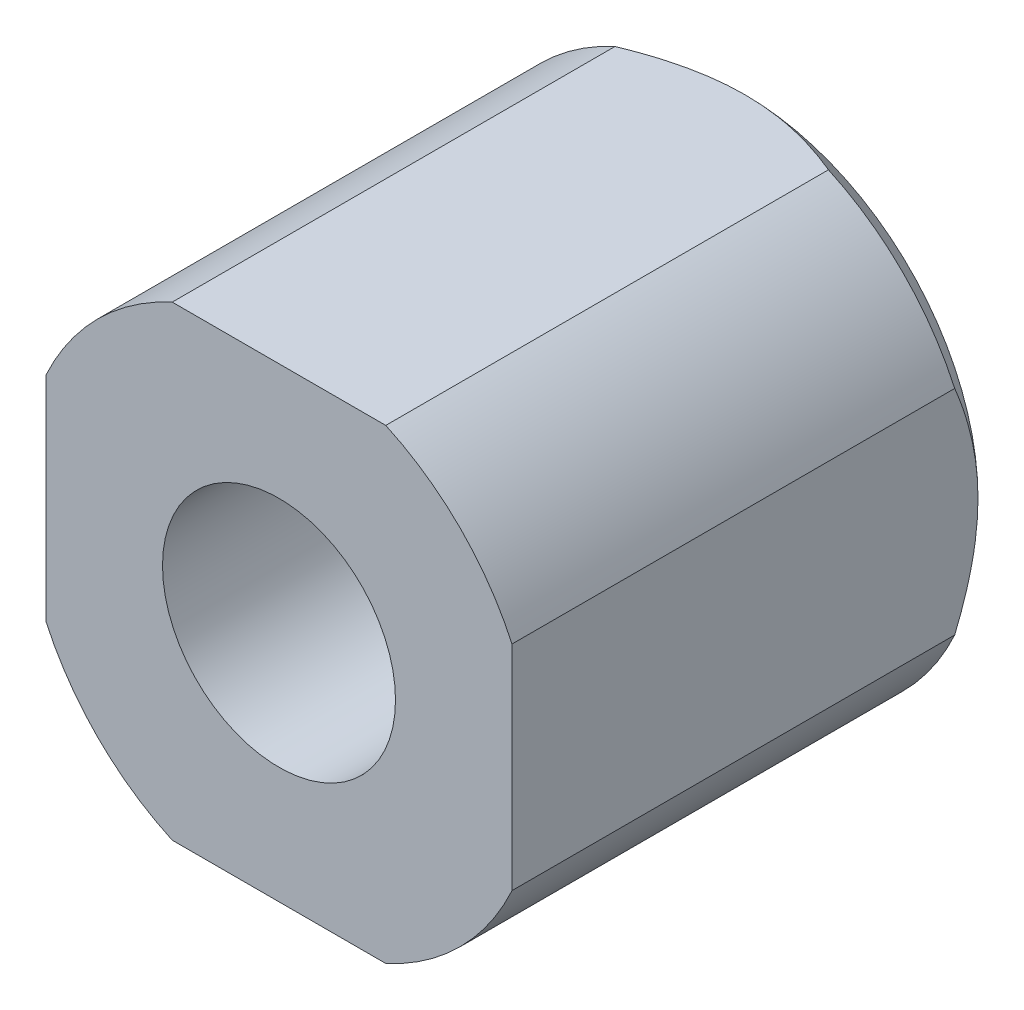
ISO-10303-21;
HEADER;
FILE_DESCRIPTION(('STEP AP214'),'2;1');
FILE_NAME('part.step','',(''),(''),'','','');
FILE_SCHEMA(('AUTOMOTIVE_DESIGN { 1 0 10303 214 1 1 1 1 }'));
ENDSEC;
DATA;
#1=APPLICATION_CONTEXT('core data for automotive mechanical design processes');
#2=APPLICATION_PROTOCOL_DEFINITION('international standard','automotive_design',2000,#1);
#3=PRODUCT_CONTEXT('',#1,'mechanical');
#4=PRODUCT('Part','Part','',(#3));
#5=PRODUCT_RELATED_PRODUCT_CATEGORY('part','',(#4));
#6=PRODUCT_DEFINITION_FORMATION('','',#4);
#7=PRODUCT_DEFINITION_CONTEXT('part definition',#1,'design');
#8=PRODUCT_DEFINITION('design','',#6,#7);
#9=PRODUCT_DEFINITION_SHAPE('','',#8);
#10=(LENGTH_UNIT() NAMED_UNIT(*) SI_UNIT(.MILLI.,.METRE.));
#11=(NAMED_UNIT(*) PLANE_ANGLE_UNIT() SI_UNIT($,.RADIAN.));
#12=(NAMED_UNIT(*) SI_UNIT($,.STERADIAN.) SOLID_ANGLE_UNIT());
#13=UNCERTAINTY_MEASURE_WITH_UNIT(LENGTH_MEASURE(1.E-05),#10,'distance_accuracy_value','');
#14=(GEOMETRIC_REPRESENTATION_CONTEXT(3) GLOBAL_UNCERTAINTY_ASSIGNED_CONTEXT((#13)) GLOBAL_UNIT_ASSIGNED_CONTEXT((#10,
#11,#12)) REPRESENTATION_CONTEXT('',''));
#15=CARTESIAN_POINT('',(0.,0.,0.));
#16=DIRECTION('',(0.,0.,1.));
#17=DIRECTION('',(1.,0.,0.));
#18=AXIS2_PLACEMENT_3D('',#15,#16,#17);
#19=CARTESIAN_POINT('',(10.,10.,20.));
#20=DIRECTION('',(0.,-1.,0.));
#21=DIRECTION('',(1.,0.,0.));
#22=AXIS2_PLACEMENT_3D('',#19,#20,#21);
#23=PLANE('',#22);
#24=DIRECTION('',(0.,0.,-1.));
#25=VECTOR('',#24,1.);
#26=CARTESIAN_POINT('',(4.58257569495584,10.,20.));
#27=LINE('',#26,#25);
#28=CARTESIAN_POINT('',(4.58257569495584,10.,1.));
#29=VERTEX_POINT('',#28);
#30=CARTESIAN_POINT('',(4.58257569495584,10.,20.));
#31=VERTEX_POINT('',#30);
#32=EDGE_CURVE('E239',#29,#31,#27,.F.);
#33=ORIENTED_EDGE('',*,*,#32,.F.);
#34=CARTESIAN_POINT('',(0.,10.,5.10430155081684E-12));
#35=CARTESIAN_POINT('',(0.153419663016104,10.,-1.77624107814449E-05));
#36=CARTESIAN_POINT('',(0.306833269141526,10.,0.00353016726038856));
#37=CARTESIAN_POINT('',(0.613315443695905,10.,0.0176254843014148));
#38=CARTESIAN_POINT('',(0.766384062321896,10.,0.0281717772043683));
#39=CARTESIAN_POINT('',(1.07166096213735,10.,0.0561108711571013));
#40=CARTESIAN_POINT('',(1.22387019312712,10.,0.0734933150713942));
#41=CARTESIAN_POINT('',(1.52738320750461,10.,0.114854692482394));
#42=CARTESIAN_POINT('',(1.67868696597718,10.,0.138833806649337));
#43=CARTESIAN_POINT('',(2.12685071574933,10.,0.219491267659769));
#44=CARTESIAN_POINT('',(2.42210425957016,10.,0.285285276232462));
#45=CARTESIAN_POINT('',(3.00688490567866,10.,0.438467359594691));
#46=CARTESIAN_POINT('',(3.29641147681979,10.,0.525857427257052));
#47=CARTESIAN_POINT('',(3.75125759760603,10.,0.67926794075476));
#48=CARTESIAN_POINT('',(3.91864293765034,10.,0.739275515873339));
#49=CARTESIAN_POINT('',(4.25191342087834,10.,0.865307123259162));
#50=CARTESIAN_POINT('',(4.41778971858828,10.,0.931354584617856));
#51=CARTESIAN_POINT('',(4.58257569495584,10.,1.));
#52=B_SPLINE_CURVE_WITH_KNOTS('',3,(#34,#35,#36,#37,#38,#39,#40,#41,#42,#43,#44,#45,#46,#47,#48,
#49,#50,#51),.UNSPECIFIED.,.F.,.F.,(4,2,2,2,2,2,2,2,4),(0.,0.460207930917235,0.920343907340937,
1.37978542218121,1.83923952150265,2.74570852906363,3.65226121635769,4.18561484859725,
4.72113306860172),.UNSPECIFIED.);
#53=CARTESIAN_POINT('',(0.,9.99999999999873,3.82855778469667E-12));
#54=VERTEX_POINT('',#53);
#55=EDGE_CURVE('E177',#54,#29,#52,.T.);
#56=ORIENTED_EDGE('',*,*,#55,.F.);
#57=CARTESIAN_POINT('',(-4.58257569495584,10.,1.));
#58=CARTESIAN_POINT('',(-4.40028329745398,10.,0.924069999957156));
#59=CARTESIAN_POINT('',(-4.21668434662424,10.,0.851318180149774));
#60=CARTESIAN_POINT('',(-3.84668711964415,10.,0.712956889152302));
#61=CARTESIAN_POINT('',(-3.66028713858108,10.,0.647351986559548));
#62=CARTESIAN_POINT('',(-3.10086162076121,10.,0.463858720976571));
#63=CARTESIAN_POINT('',(-2.72381902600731,10.,0.357678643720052));
#64=CARTESIAN_POINT('',(-2.15145029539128,10.,0.227123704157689));
#65=CARTESIAN_POINT('',(-1.95932775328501,10.,0.188366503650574));
#66=CARTESIAN_POINT('',(-1.57326186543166,10.,0.121217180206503));
#67=CARTESIAN_POINT('',(-1.37931860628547,10.,0.0928245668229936));
#68=CARTESIAN_POINT('',(-0.988206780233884,10.,0.0468172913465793));
#69=CARTESIAN_POINT('',(-0.791025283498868,10.,0.0293119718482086));
#70=CARTESIAN_POINT('',(-0.395902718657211,10.,0.00587701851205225));
#71=CARTESIAN_POINT('',(-0.197961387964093,10.,-4.81679352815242E-05));
#72=CARTESIAN_POINT('',(0.,10.,5.10354999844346E-12));
#73=B_SPLINE_CURVE_WITH_KNOTS('',3,(#57,#58,#59,#60,#61,#62,#63,#64,#65,#66,#67,#68,#69,#70,#71,
#72),.UNSPECIFIED.,.F.,.F.,(4,2,2,2,2,2,2,4),(0.,0.592342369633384,1.18506119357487,
2.3581712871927,2.94592281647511,3.53364653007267,4.12718135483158,4.72094408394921),.UNSPECIFIED.);
#74=CARTESIAN_POINT('',(-4.58257569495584,10.,1.));
#75=VERTEX_POINT('',#74);
#76=EDGE_CURVE('E184',#75,#54,#73,.T.);
#77=ORIENTED_EDGE('',*,*,#76,.F.);
#78=DIRECTION('',(0.,0.,-1.));
#79=VECTOR('',#78,1.);
#80=CARTESIAN_POINT('',(-4.58257569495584,10.,20.));
#81=LINE('',#80,#79);
#82=CARTESIAN_POINT('',(-4.58257569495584,10.,20.));
#83=VERTEX_POINT('',#82);
#84=EDGE_CURVE('E230',#83,#75,#81,.T.);
#85=ORIENTED_EDGE('',*,*,#84,.F.);
#86=DIRECTION('',(1.,0.,0.));
#87=VECTOR('',#86,1.);
#88=CARTESIAN_POINT('',(0.,10.,20.));
#89=LINE('',#88,#87);
#90=EDGE_CURVE('E221',#31,#83,#89,.F.);
#91=ORIENTED_EDGE('',*,*,#90,.F.);
#92=EDGE_LOOP('',(#33,#56,#77,#85,#91));
#93=FACE_BOUND('',#92,.T.);
#94=ADVANCED_FACE('F14',(#93),#23,.F.);
#95=CARTESIAN_POINT('',(0.,0.,20.));
#96=DIRECTION('',(0.,0.,-1.));
#97=DIRECTION('',(-1.,0.,0.));
#98=AXIS2_PLACEMENT_3D('',#95,#96,#97);
#99=CYLINDRICAL_SURFACE('',#98,11.);
#100=CARTESIAN_POINT('',(0.,0.,20.));
#101=DIRECTION('',(0.,0.,-1.));
#102=DIRECTION('',(-1.,0.,0.));
#103=AXIS2_PLACEMENT_3D('',#100,#101,#102);
#104=CIRCLE('',#103,11.);
#105=CARTESIAN_POINT('',(-10.,4.58257569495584,20.));
#106=VERTEX_POINT('',#105);
#107=EDGE_CURVE('E220',#83,#106,#104,.F.);
#108=ORIENTED_EDGE('',*,*,#107,.F.);
#109=ORIENTED_EDGE('',*,*,#84,.T.);
#110=CARTESIAN_POINT('',(0.,0.,1.));
#111=DIRECTION('',(0.,0.,1.));
#112=DIRECTION('',(1.,0.,0.));
#113=AXIS2_PLACEMENT_3D('',#110,#111,#112);
#114=CIRCLE('',#113,11.);
#115=CARTESIAN_POINT('',(-10.,4.58257569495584,1.));
#116=VERTEX_POINT('',#115);
#117=EDGE_CURVE('E189',#116,#75,#114,.F.);
#118=ORIENTED_EDGE('',*,*,#117,.F.);
#119=DIRECTION('',(0.,0.,-1.));
#120=VECTOR('',#119,1.);
#121=CARTESIAN_POINT('',(-10.,4.58257569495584,20.));
#122=LINE('',#121,#120);
#123=EDGE_CURVE('E232',#116,#106,#122,.F.);
#124=ORIENTED_EDGE('',*,*,#123,.T.);
#125=EDGE_LOOP('',(#108,#109,#118,#124));
#126=FACE_BOUND('',#125,.T.);
#127=ADVANCED_FACE('F254',(#126),#99,.T.);
#128=CARTESIAN_POINT('',(-10.,10.,20.));
#129=DIRECTION('',(1.,0.,0.));
#130=DIRECTION('',(0.,0.,-1.));
#131=AXIS2_PLACEMENT_3D('',#128,#129,#130);
#132=PLANE('',#131);
#133=ORIENTED_EDGE('',*,*,#123,.F.);
#134=CARTESIAN_POINT('',(-10.,0.,5.10432619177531E-12));
#135=CARTESIAN_POINT('',(-10.,0.153419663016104,-1.77624107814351E-05));
#136=CARTESIAN_POINT('',(-10.,0.306833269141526,0.00353016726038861));
#137=CARTESIAN_POINT('',(-10.,0.613315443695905,0.017625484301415));
#138=CARTESIAN_POINT('',(-10.,0.766384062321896,0.0281717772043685));
#139=CARTESIAN_POINT('',(-10.,1.07166096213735,0.0561108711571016));
#140=CARTESIAN_POINT('',(-10.,1.22387019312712,0.0734933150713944));
#141=CARTESIAN_POINT('',(-10.,1.52738320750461,0.114854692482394));
#142=CARTESIAN_POINT('',(-10.,1.67868696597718,0.138833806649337));
#143=CARTESIAN_POINT('',(-10.,2.12685071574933,0.219491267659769));
#144=CARTESIAN_POINT('',(-10.,2.42210425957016,0.285285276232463));
#145=CARTESIAN_POINT('',(-10.,3.00688490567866,0.438467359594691));
#146=CARTESIAN_POINT('',(-10.,3.29641147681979,0.525857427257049));
#147=CARTESIAN_POINT('',(-10.,3.75125759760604,0.679267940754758));
#148=CARTESIAN_POINT('',(-10.,3.91864293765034,0.739275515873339));
#149=CARTESIAN_POINT('',(-10.,4.25191342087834,0.865307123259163));
#150=CARTESIAN_POINT('',(-10.,4.41778971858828,0.931354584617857));
#151=CARTESIAN_POINT('',(-10.,4.58257569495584,1.));
#152=B_SPLINE_CURVE_WITH_KNOTS('',3,(#134,#135,#136,#137,#138,#139,#140,#141,#142,#143,#144,
#145,#146,#147,#148,#149,#150,#151),.UNSPECIFIED.,.F.,.F.,(4,2,2,2,2,2,2,2,4),(0.,
0.460207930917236,0.920343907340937,1.37978542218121,1.83923952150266,2.74570852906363,
3.65226121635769,4.18561484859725,4.72113306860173),.UNSPECIFIED.);
#153=CARTESIAN_POINT('',(-9.99999999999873,0.,3.82858023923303E-12));
#154=VERTEX_POINT('',#153);
#155=EDGE_CURVE('E18',#154,#116,#152,.T.);
#156=ORIENTED_EDGE('',*,*,#155,.F.);
#157=CARTESIAN_POINT('',(-10.,-4.58257569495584,1.));
#158=CARTESIAN_POINT('',(-10.,-4.40028329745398,0.924069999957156));
#159=CARTESIAN_POINT('',(-10.,-4.21668434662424,0.851318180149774));
#160=CARTESIAN_POINT('',(-10.,-3.84668711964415,0.712956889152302));
#161=CARTESIAN_POINT('',(-10.,-3.66028713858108,0.647351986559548));
#162=CARTESIAN_POINT('',(-10.,-3.10086162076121,0.463858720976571));
#163=CARTESIAN_POINT('',(-10.,-2.72381902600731,0.357678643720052));
#164=CARTESIAN_POINT('',(-10.,-2.15145029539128,0.227123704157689));
#165=CARTESIAN_POINT('',(-10.,-1.95932775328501,0.188366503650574));
#166=CARTESIAN_POINT('',(-10.,-1.57326186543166,0.121217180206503));
#167=CARTESIAN_POINT('',(-10.,-1.37931860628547,0.0928245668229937));
#168=CARTESIAN_POINT('',(-10.,-0.988206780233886,0.0468172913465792));
#169=CARTESIAN_POINT('',(-10.,-0.791025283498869,0.0293119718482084));
#170=CARTESIAN_POINT('',(-10.,-0.395902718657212,0.00587701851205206));
#171=CARTESIAN_POINT('',(-10.,-0.197961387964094,-4.81679352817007E-05));
#172=CARTESIAN_POINT('',(-10.,0.,5.10344157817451E-12));
#173=B_SPLINE_CURVE_WITH_KNOTS('',3,(#157,#158,#159,#160,#161,#162,#163,#164,#165,#166,#167,
#168,#169,#170,#171,#172),.UNSPECIFIED.,.F.,.F.,(4,2,2,2,2,2,2,4),(0.,0.592342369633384,
1.18506119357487,2.3581712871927,2.9459228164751,3.53364653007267,4.12718135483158,
4.72094408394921),.UNSPECIFIED.);
#174=CARTESIAN_POINT('',(-10.,-4.58257569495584,1.));
#175=VERTEX_POINT('',#174);
#176=EDGE_CURVE('E68',#175,#154,#173,.T.);
#177=ORIENTED_EDGE('',*,*,#176,.F.);
#178=DIRECTION('',(0.,0.,-1.));
#179=VECTOR('',#178,1.);
#180=CARTESIAN_POINT('',(-10.,-4.58257569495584,20.));
#181=LINE('',#180,#179);
#182=CARTESIAN_POINT('',(-10.,-4.58257569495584,20.));
#183=VERTEX_POINT('',#182);
#184=EDGE_CURVE('E107',#183,#175,#181,.T.);
#185=ORIENTED_EDGE('',*,*,#184,.F.);
#186=DIRECTION('',(0.,1.,0.));
#187=VECTOR('',#186,1.);
#188=CARTESIAN_POINT('',(-10.,5.,20.));
#189=LINE('',#188,#187);
#190=EDGE_CURVE('E219',#106,#183,#189,.F.);
#191=ORIENTED_EDGE('',*,*,#190,.F.);
#192=EDGE_LOOP('',(#133,#156,#177,#185,#191));
#193=FACE_BOUND('',#192,.T.);
#194=ADVANCED_FACE('F247',(#193),#132,.F.);
#195=CARTESIAN_POINT('',(0.,0.,20.));
#196=DIRECTION('',(0.,0.,-1.));
#197=DIRECTION('',(-1.,0.,0.));
#198=AXIS2_PLACEMENT_3D('',#195,#196,#197);
#199=CYLINDRICAL_SURFACE('',#198,11.);
#200=CARTESIAN_POINT('',(0.,0.,20.));
#201=DIRECTION('',(0.,0.,-1.));
#202=DIRECTION('',(-1.,0.,0.));
#203=AXIS2_PLACEMENT_3D('',#200,#201,#202);
#204=CIRCLE('',#203,11.);
#205=CARTESIAN_POINT('',(-4.58257569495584,-10.,20.));
#206=VERTEX_POINT('',#205);
#207=EDGE_CURVE('E217',#183,#206,#204,.F.);
#208=ORIENTED_EDGE('',*,*,#207,.F.);
#209=ORIENTED_EDGE('',*,*,#184,.T.);
#210=CARTESIAN_POINT('',(0.,0.,1.));
#211=DIRECTION('',(0.,0.,1.));
#212=DIRECTION('',(1.,0.,0.));
#213=AXIS2_PLACEMENT_3D('',#210,#211,#212);
#214=CIRCLE('',#213,11.);
#215=CARTESIAN_POINT('',(-4.58257569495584,-10.,1.));
#216=VERTEX_POINT('',#215);
#217=EDGE_CURVE('E226',#216,#175,#214,.F.);
#218=ORIENTED_EDGE('',*,*,#217,.F.);
#219=DIRECTION('',(0.,0.,1.));
#220=VECTOR('',#219,1.);
#221=CARTESIAN_POINT('',(-4.58257569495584,-10.,20.));
#222=LINE('',#221,#220);
#223=EDGE_CURVE('E121',#216,#206,#222,.T.);
#224=ORIENTED_EDGE('',*,*,#223,.T.);
#225=EDGE_LOOP('',(#208,#209,#218,#224));
#226=FACE_BOUND('',#225,.T.);
#227=ADVANCED_FACE('F245',(#226),#199,.T.);
#228=CARTESIAN_POINT('',(-10.,-10.,20.));
#229=DIRECTION('',(0.,1.,0.));
#230=DIRECTION('',(-1.,0.,0.));
#231=AXIS2_PLACEMENT_3D('',#228,#229,#230);
#232=PLANE('',#231);
#233=ORIENTED_EDGE('',*,*,#223,.F.);
#234=CARTESIAN_POINT('',(0.,-10.,5.10437547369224E-12));
#235=CARTESIAN_POINT('',(-0.153419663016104,-10.,-1.77624107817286E-05));
#236=CARTESIAN_POINT('',(-0.306833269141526,-10.,0.00353016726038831));
#237=CARTESIAN_POINT('',(-0.613315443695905,-10.,0.0176254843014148));
#238=CARTESIAN_POINT('',(-0.766384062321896,-10.,0.0281717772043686));
#239=CARTESIAN_POINT('',(-1.07166096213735,-10.,0.0561108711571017));
#240=CARTESIAN_POINT('',(-1.22387019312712,-10.,0.0734933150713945));
#241=CARTESIAN_POINT('',(-1.52738320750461,-10.,0.114854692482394));
#242=CARTESIAN_POINT('',(-1.67868696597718,-10.,0.138833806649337));
#243=CARTESIAN_POINT('',(-2.12685071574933,-10.,0.219491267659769));
#244=CARTESIAN_POINT('',(-2.42210425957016,-10.,0.285285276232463));
#245=CARTESIAN_POINT('',(-3.00688490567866,-10.,0.438467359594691));
#246=CARTESIAN_POINT('',(-3.29641147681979,-10.,0.525857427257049));
#247=CARTESIAN_POINT('',(-3.75125759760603,-10.,0.679267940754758));
#248=CARTESIAN_POINT('',(-3.91864293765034,-10.,0.739275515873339));
#249=CARTESIAN_POINT('',(-4.25191342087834,-10.,0.865307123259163));
#250=CARTESIAN_POINT('',(-4.41778971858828,-10.,0.931354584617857));
#251=CARTESIAN_POINT('',(-4.58257569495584,-10.,1.));
#252=B_SPLINE_CURVE_WITH_KNOTS('',3,(#234,#235,#236,#237,#238,#239,#240,#241,#242,#243,#244,
#245,#246,#247,#248,#249,#250,#251),.UNSPECIFIED.,.F.,.F.,(4,2,2,2,2,2,2,2,4),(0.,
0.460207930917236,0.920343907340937,1.37978542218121,1.83923952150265,2.74570852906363,
3.65226121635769,4.18561484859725,4.72113306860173),.UNSPECIFIED.);
#253=CARTESIAN_POINT('',(0.,-9.99999999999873,3.82855981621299E-12));
#254=VERTEX_POINT('',#253);
#255=EDGE_CURVE('E131',#254,#216,#252,.T.);
#256=ORIENTED_EDGE('',*,*,#255,.F.);
#257=CARTESIAN_POINT('',(4.58257569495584,-10.,1.));
#258=CARTESIAN_POINT('',(4.40028329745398,-10.,0.924069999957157));
#259=CARTESIAN_POINT('',(4.21668434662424,-10.,0.851318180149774));
#260=CARTESIAN_POINT('',(3.84668711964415,-10.,0.712956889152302));
#261=CARTESIAN_POINT('',(3.66028713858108,-10.,0.647351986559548));
#262=CARTESIAN_POINT('',(3.10086162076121,-10.,0.463858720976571));
#263=CARTESIAN_POINT('',(2.72381902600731,-10.,0.357678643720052));
#264=CARTESIAN_POINT('',(2.15145029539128,-10.,0.22712370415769));
#265=CARTESIAN_POINT('',(1.95932775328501,-10.,0.188366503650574));
#266=CARTESIAN_POINT('',(1.57326186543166,-10.,0.121217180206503));
#267=CARTESIAN_POINT('',(1.37931860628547,-10.,0.0928245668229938));
#268=CARTESIAN_POINT('',(0.988206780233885,-10.,0.0468172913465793));
#269=CARTESIAN_POINT('',(0.791025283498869,-10.,0.0293119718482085));
#270=CARTESIAN_POINT('',(0.395902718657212,-10.,0.00587701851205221));
#271=CARTESIAN_POINT('',(0.197961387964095,-10.,-4.81679352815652E-05));
#272=CARTESIAN_POINT('',(0.,-10.,5.10346022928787E-12));
#273=B_SPLINE_CURVE_WITH_KNOTS('',3,(#257,#258,#259,#260,#261,#262,#263,#264,#265,#266,#267,
#268,#269,#270,#271,#272),.UNSPECIFIED.,.F.,.F.,(4,2,2,2,2,2,2,4),(0.,0.592342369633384,
1.18506119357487,2.3581712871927,2.9459228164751,3.53364653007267,4.12718135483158,
4.72094408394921),.UNSPECIFIED.);
#274=CARTESIAN_POINT('',(4.58257569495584,-10.,1.));
#275=VERTEX_POINT('',#274);
#276=EDGE_CURVE('E39',#275,#254,#273,.T.);
#277=ORIENTED_EDGE('',*,*,#276,.F.);
#278=DIRECTION('',(0.,0.,-1.));
#279=VECTOR('',#278,1.);
#280=CARTESIAN_POINT('',(4.58257569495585,-10.,20.));
#281=LINE('',#280,#279);
#282=CARTESIAN_POINT('',(4.58257569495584,-10.,20.));
#283=VERTEX_POINT('',#282);
#284=EDGE_CURVE('E113',#283,#275,#281,.T.);
#285=ORIENTED_EDGE('',*,*,#284,.F.);
#286=DIRECTION('',(1.,0.,0.));
#287=VECTOR('',#286,1.);
#288=CARTESIAN_POINT('',(0.,-10.,20.));
#289=LINE('',#288,#287);
#290=EDGE_CURVE('E216',#206,#283,#289,.T.);
#291=ORIENTED_EDGE('',*,*,#290,.F.);
#292=EDGE_LOOP('',(#233,#256,#277,#285,#291));
#293=FACE_BOUND('',#292,.T.);
#294=ADVANCED_FACE('F129',(#293),#232,.F.);
#295=CARTESIAN_POINT('',(0.,0.,20.));
#296=DIRECTION('',(0.,0.,-1.));
#297=DIRECTION('',(-1.,0.,0.));
#298=AXIS2_PLACEMENT_3D('',#295,#296,#297);
#299=CYLINDRICAL_SURFACE('',#298,11.);
#300=CARTESIAN_POINT('',(0.,0.,20.));
#301=DIRECTION('',(0.,0.,-1.));
#302=DIRECTION('',(-1.,0.,0.));
#303=AXIS2_PLACEMENT_3D('',#300,#301,#302);
#304=CIRCLE('',#303,11.);
#305=CARTESIAN_POINT('',(10.,-4.58257569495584,20.));
#306=VERTEX_POINT('',#305);
#307=EDGE_CURVE('E117',#283,#306,#304,.F.);
#308=ORIENTED_EDGE('',*,*,#307,.F.);
#309=ORIENTED_EDGE('',*,*,#284,.T.);
#310=CARTESIAN_POINT('',(0.,0.,1.));
#311=DIRECTION('',(0.,0.,1.));
#312=DIRECTION('',(1.,0.,0.));
#313=AXIS2_PLACEMENT_3D('',#310,#311,#312);
#314=CIRCLE('',#313,11.);
#315=CARTESIAN_POINT('',(10.,-4.58257569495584,1.));
#316=VERTEX_POINT('',#315);
#317=EDGE_CURVE('E116',#316,#275,#314,.F.);
#318=ORIENTED_EDGE('',*,*,#317,.F.);
#319=DIRECTION('',(0.,0.,1.));
#320=VECTOR('',#319,1.);
#321=CARTESIAN_POINT('',(10.,-4.58257569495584,20.));
#322=LINE('',#321,#320);
#323=EDGE_CURVE('E120',#316,#306,#322,.T.);
#324=ORIENTED_EDGE('',*,*,#323,.T.);
#325=EDGE_LOOP('',(#308,#309,#318,#324));
#326=FACE_BOUND('',#325,.T.);
#327=ADVANCED_FACE('F114',(#326),#299,.T.);
#328=CARTESIAN_POINT('',(10.,-10.,20.));
#329=DIRECTION('',(-1.,0.,0.));
#330=DIRECTION('',(0.,0.,1.));
#331=AXIS2_PLACEMENT_3D('',#328,#329,#330);
#332=PLANE('',#331);
#333=ORIENTED_EDGE('',*,*,#323,.F.);
#334=CARTESIAN_POINT('',(10.,0.,5.10432619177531E-12));
#335=CARTESIAN_POINT('',(10.,-0.153419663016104,-1.77624107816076E-05));
#336=CARTESIAN_POINT('',(10.,-0.306833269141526,0.00353016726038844));
#337=CARTESIAN_POINT('',(10.,-0.613315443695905,0.0176254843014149));
#338=CARTESIAN_POINT('',(10.,-0.766384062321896,0.0281717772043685));
#339=CARTESIAN_POINT('',(10.,-1.07166096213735,0.0561108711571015));
#340=CARTESIAN_POINT('',(10.,-1.22387019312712,0.0734933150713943));
#341=CARTESIAN_POINT('',(10.,-1.52738320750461,0.114854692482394));
#342=CARTESIAN_POINT('',(10.,-1.67868696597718,0.138833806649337));
#343=CARTESIAN_POINT('',(10.,-2.12685071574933,0.219491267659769));
#344=CARTESIAN_POINT('',(10.,-2.42210425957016,0.285285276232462));
#345=CARTESIAN_POINT('',(10.,-3.00688490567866,0.438467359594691));
#346=CARTESIAN_POINT('',(10.,-3.29641147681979,0.525857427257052));
#347=CARTESIAN_POINT('',(10.,-3.75125759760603,0.67926794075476));
#348=CARTESIAN_POINT('',(10.,-3.91864293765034,0.739275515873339));
#349=CARTESIAN_POINT('',(10.,-4.25191342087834,0.865307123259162));
#350=CARTESIAN_POINT('',(10.,-4.41778971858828,0.931354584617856));
#351=CARTESIAN_POINT('',(10.,-4.58257569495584,1.));
#352=B_SPLINE_CURVE_WITH_KNOTS('',3,(#334,#335,#336,#337,#338,#339,#340,#341,#342,#343,#344,
#345,#346,#347,#348,#349,#350,#351),.UNSPECIFIED.,.F.,.F.,(4,2,2,2,2,2,2,2,4),(0.,
0.460207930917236,0.920343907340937,1.37978542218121,1.83923952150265,2.74570852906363,
3.65226121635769,4.18561484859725,4.72113306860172),.UNSPECIFIED.);
#353=CARTESIAN_POINT('',(9.99999999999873,0.,3.82853534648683E-12));
#354=VERTEX_POINT('',#353);
#355=EDGE_CURVE('E126',#354,#316,#352,.T.);
#356=ORIENTED_EDGE('',*,*,#355,.F.);
#357=CARTESIAN_POINT('',(10.,4.58257569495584,1.));
#358=CARTESIAN_POINT('',(10.,4.40028329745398,0.924069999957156));
#359=CARTESIAN_POINT('',(10.,4.21668434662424,0.851318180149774));
#360=CARTESIAN_POINT('',(10.,3.84668711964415,0.712956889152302));
#361=CARTESIAN_POINT('',(10.,3.66028713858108,0.647351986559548));
#362=CARTESIAN_POINT('',(10.,3.10086162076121,0.463858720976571));
#363=CARTESIAN_POINT('',(10.,2.72381902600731,0.357678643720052));
#364=CARTESIAN_POINT('',(10.,2.15145029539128,0.227123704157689));
#365=CARTESIAN_POINT('',(10.,1.95932775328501,0.188366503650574));
#366=CARTESIAN_POINT('',(10.,1.57326186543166,0.121217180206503));
#367=CARTESIAN_POINT('',(10.,1.37931860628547,0.0928245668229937));
#368=CARTESIAN_POINT('',(10.,0.988206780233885,0.0468172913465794));
#369=CARTESIAN_POINT('',(10.,0.791025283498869,0.0293119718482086));
#370=CARTESIAN_POINT('',(10.,0.395902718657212,0.0058770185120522));
#371=CARTESIAN_POINT('',(10.,0.197961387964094,-4.81679352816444E-05));
#372=CARTESIAN_POINT('',(10.,0.,5.1033517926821E-12));
#373=B_SPLINE_CURVE_WITH_KNOTS('',3,(#357,#358,#359,#360,#361,#362,#363,#364,#365,#366,#367,
#368,#369,#370,#371,#372),.UNSPECIFIED.,.F.,.F.,(4,2,2,2,2,2,2,4),(0.,0.592342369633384,
1.18506119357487,2.3581712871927,2.9459228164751,3.53364653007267,4.12718135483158,
4.72094408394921),.UNSPECIFIED.);
#374=CARTESIAN_POINT('',(10.,4.58257569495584,1.));
#375=VERTEX_POINT('',#374);
#376=EDGE_CURVE('E171',#375,#354,#373,.T.);
#377=ORIENTED_EDGE('',*,*,#376,.F.);
#378=DIRECTION('',(0.,0.,-1.));
#379=VECTOR('',#378,1.);
#380=CARTESIAN_POINT('',(10.,4.58257569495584,20.));
#381=LINE('',#380,#379);
#382=CARTESIAN_POINT('',(10.,4.58257569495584,20.));
#383=VERTEX_POINT('',#382);
#384=EDGE_CURVE('E198',#383,#375,#381,.T.);
#385=ORIENTED_EDGE('',*,*,#384,.F.);
#386=DIRECTION('',(0.,1.,0.));
#387=VECTOR('',#386,1.);
#388=CARTESIAN_POINT('',(10.,5.,20.));
#389=LINE('',#388,#387);
#390=EDGE_CURVE('E77',#306,#383,#389,.T.);
#391=ORIENTED_EDGE('',*,*,#390,.F.);
#392=EDGE_LOOP('',(#333,#356,#377,#385,#391));
#393=FACE_BOUND('',#392,.T.);
#394=ADVANCED_FACE('F306',(#393),#332,.F.);
#395=CARTESIAN_POINT('',(0.,0.,20.));
#396=DIRECTION('',(0.,0.,-1.));
#397=DIRECTION('',(-1.,0.,0.));
#398=AXIS2_PLACEMENT_3D('',#395,#396,#397);
#399=CYLINDRICAL_SURFACE('',#398,11.);
#400=CARTESIAN_POINT('',(0.,0.,20.));
#401=DIRECTION('',(0.,0.,-1.));
#402=DIRECTION('',(-1.,0.,0.));
#403=AXIS2_PLACEMENT_3D('',#400,#401,#402);
#404=CIRCLE('',#403,11.);
#405=EDGE_CURVE('E213',#383,#31,#404,.F.);
#406=ORIENTED_EDGE('',*,*,#405,.F.);
#407=ORIENTED_EDGE('',*,*,#384,.T.);
#408=CARTESIAN_POINT('',(0.,0.,1.));
#409=DIRECTION('',(0.,0.,1.));
#410=DIRECTION('',(1.,0.,0.));
#411=AXIS2_PLACEMENT_3D('',#408,#409,#410);
#412=CIRCLE('',#411,11.);
#413=EDGE_CURVE('E183',#29,#375,#412,.F.);
#414=ORIENTED_EDGE('',*,*,#413,.F.);
#415=ORIENTED_EDGE('',*,*,#32,.T.);
#416=EDGE_LOOP('',(#406,#407,#414,#415));
#417=FACE_BOUND('',#416,.T.);
#418=ADVANCED_FACE('F299',(#417),#399,.T.);
#419=CARTESIAN_POINT('',(0.,0.,1.));
#420=DIRECTION('',(0.,0.,1.));
#421=DIRECTION('',(1.,0.,0.));
#422=AXIS2_PLACEMENT_3D('',#419,#420,#421);
#423=CONICAL_SURFACE('',#422,11.,0.7853981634);
#424=ORIENTED_EDGE('',*,*,#76,.T.);
#425=CARTESIAN_POINT('',(0.,0.,2.55264559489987E-12));
#426=DIRECTION('',(0.,0.,1.));
#427=DIRECTION('',(1.,0.,0.));
#428=AXIS2_PLACEMENT_3D('',#425,#426,#427);
#429=CIRCLE('',#428,9.99999999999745);
#430=EDGE_CURVE('E211',#154,#54,#429,.F.);
#431=ORIENTED_EDGE('',*,*,#430,.F.);
#432=ORIENTED_EDGE('',*,*,#155,.T.);
#433=ORIENTED_EDGE('',*,*,#117,.T.);
#434=EDGE_LOOP('',(#424,#431,#432,#433));
#435=FACE_BOUND('',#434,.T.);
#436=ADVANCED_FACE('F166',(#435),#423,.T.);
#437=CARTESIAN_POINT('',(0.,0.,1.));
#438=DIRECTION('',(0.,0.,1.));
#439=DIRECTION('',(0.,1.,0.));
#440=AXIS2_PLACEMENT_3D('',#437,#438,#439);
#441=CONICAL_SURFACE('',#440,11.,0.7853981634);
#442=ORIENTED_EDGE('',*,*,#376,.T.);
#443=CARTESIAN_POINT('',(0.,0.,2.55264559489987E-12));
#444=DIRECTION('',(0.,0.,1.));
#445=DIRECTION('',(0.,1.,0.));
#446=AXIS2_PLACEMENT_3D('',#443,#444,#445);
#447=CIRCLE('',#446,9.99999999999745);
#448=EDGE_CURVE('E208',#54,#354,#447,.F.);
#449=ORIENTED_EDGE('',*,*,#448,.F.);
#450=ORIENTED_EDGE('',*,*,#55,.T.);
#451=ORIENTED_EDGE('',*,*,#413,.T.);
#452=EDGE_LOOP('',(#442,#449,#450,#451));
#453=FACE_BOUND('',#452,.T.);
#454=ADVANCED_FACE('F160',(#453),#441,.T.);
#455=CARTESIAN_POINT('',(0.,0.,1.));
#456=DIRECTION('',(0.,0.,1.));
#457=DIRECTION('',(0.,1.,0.));
#458=AXIS2_PLACEMENT_3D('',#455,#456,#457);
#459=CONICAL_SURFACE('',#458,11.,0.7853981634);
#460=ORIENTED_EDGE('',*,*,#276,.T.);
#461=CARTESIAN_POINT('',(0.,0.,2.55264559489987E-12));
#462=DIRECTION('',(0.,0.,1.));
#463=DIRECTION('',(0.,1.,0.));
#464=AXIS2_PLACEMENT_3D('',#461,#462,#463);
#465=CIRCLE('',#464,9.99999999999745);
#466=EDGE_CURVE('E206',#354,#254,#465,.F.);
#467=ORIENTED_EDGE('',*,*,#466,.F.);
#468=ORIENTED_EDGE('',*,*,#355,.T.);
#469=ORIENTED_EDGE('',*,*,#317,.T.);
#470=EDGE_LOOP('',(#460,#467,#468,#469));
#471=FACE_BOUND('',#470,.T.);
#472=ADVANCED_FACE('F124',(#471),#459,.T.);
#473=CARTESIAN_POINT('',(0.,0.,1.));
#474=DIRECTION('',(0.,0.,1.));
#475=DIRECTION('',(0.,1.,0.));
#476=AXIS2_PLACEMENT_3D('',#473,#474,#475);
#477=CONICAL_SURFACE('',#476,11.,0.7853981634);
#478=ORIENTED_EDGE('',*,*,#255,.T.);
#479=ORIENTED_EDGE('',*,*,#217,.T.);
#480=ORIENTED_EDGE('',*,*,#176,.T.);
#481=CARTESIAN_POINT('',(0.,0.,2.55264559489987E-12));
#482=DIRECTION('',(0.,0.,1.));
#483=DIRECTION('',(0.,1.,0.));
#484=AXIS2_PLACEMENT_3D('',#481,#482,#483);
#485=CIRCLE('',#484,9.99999999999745);
#486=EDGE_CURVE('E203',#254,#154,#485,.F.);
#487=ORIENTED_EDGE('',*,*,#486,.F.);
#488=EDGE_LOOP('',(#478,#479,#480,#487));
#489=FACE_BOUND('',#488,.T.);
#490=ADVANCED_FACE('F159',(#489),#477,.T.);
#491=CARTESIAN_POINT('',(0.,5.,20.));
#492=DIRECTION('',(0.,0.,1.));
#493=DIRECTION('',(1.,0.,0.));
#494=AXIS2_PLACEMENT_3D('',#491,#492,#493);
#495=PLANE('',#494);
#496=CARTESIAN_POINT('',(0.,0.,20.));
#497=DIRECTION('',(0.,0.,-1.));
#498=DIRECTION('',(-1.,0.,0.));
#499=AXIS2_PLACEMENT_3D('',#496,#497,#498);
#500=CIRCLE('',#499,5.);
#501=CARTESIAN_POINT('',(-5.,0.,20.));
#502=VERTEX_POINT('',#501);
#503=EDGE_CURVE('E30',#502,#502,#500,.T.);
#504=ORIENTED_EDGE('',*,*,#503,.T.);
#505=EDGE_LOOP('',(#504));
#506=FACE_BOUND('',#505,.T.);
#507=ORIENTED_EDGE('',*,*,#390,.T.);
#508=ORIENTED_EDGE('',*,*,#405,.T.);
#509=ORIENTED_EDGE('',*,*,#90,.T.);
#510=ORIENTED_EDGE('',*,*,#107,.T.);
#511=ORIENTED_EDGE('',*,*,#190,.T.);
#512=ORIENTED_EDGE('',*,*,#207,.T.);
#513=ORIENTED_EDGE('',*,*,#290,.T.);
#514=ORIENTED_EDGE('',*,*,#307,.T.);
#515=EDGE_LOOP('',(#507,#508,#509,#510,#511,#512,#513,#514));
#516=FACE_BOUND('',#515,.T.);
#517=ADVANCED_FACE('F244',(#506,#516),#495,.T.);
#518=CARTESIAN_POINT('',(0.,10.,0.));
#519=DIRECTION('',(0.,0.,-1.));
#520=DIRECTION('',(-1.,0.,0.));
#521=AXIS2_PLACEMENT_3D('',#518,#519,#520);
#522=PLANE('',#521);
#523=ORIENTED_EDGE('',*,*,#466,.T.);
#524=ORIENTED_EDGE('',*,*,#486,.T.);
#525=ORIENTED_EDGE('',*,*,#430,.T.);
#526=ORIENTED_EDGE('',*,*,#448,.T.);
#527=EDGE_LOOP('',(#523,#524,#525,#526));
#528=FACE_BOUND('',#527,.T.);
#529=CARTESIAN_POINT('',(0.,0.,0.));
#530=DIRECTION('',(0.,0.,-1.));
#531=DIRECTION('',(-1.,0.,0.));
#532=AXIS2_PLACEMENT_3D('',#529,#530,#531);
#533=CIRCLE('',#532,5.);
#534=CARTESIAN_POINT('',(-5.,0.,0.));
#535=VERTEX_POINT('',#534);
#536=EDGE_CURVE('E9',#535,#535,#533,.F.);
#537=ORIENTED_EDGE('',*,*,#536,.T.);
#538=EDGE_LOOP('',(#537));
#539=FACE_BOUND('',#538,.T.);
#540=ADVANCED_FACE('F258',(#528,#539),#522,.T.);
#541=CARTESIAN_POINT('',(0.,0.,20.));
#542=DIRECTION('',(0.,0.,-1.));
#543=DIRECTION('',(-1.,0.,0.));
#544=AXIS2_PLACEMENT_3D('',#541,#542,#543);
#545=CYLINDRICAL_SURFACE('',#544,5.);
#546=ORIENTED_EDGE('',*,*,#536,.F.);
#547=EDGE_LOOP('',(#546));
#548=FACE_BOUND('',#547,.T.);
#549=ORIENTED_EDGE('',*,*,#503,.F.);
#550=EDGE_LOOP('',(#549));
#551=FACE_BOUND('',#550,.T.);
#552=ADVANCED_FACE('F256',(#548,#551),#545,.F.);
#553=CLOSED_SHELL('',(#94,#127,#194,#227,#294,#327,#394,#418,#436,#454,#472,#490,#517,#540,#552));
#554=MANIFOLD_SOLID_BREP('B1',#553);
#555=ADVANCED_BREP_SHAPE_REPRESENTATION('',(#18,#554),#14);
#556=SHAPE_DEFINITION_REPRESENTATION(#9,#555);
ENDSEC;
END-ISO-10303-21;
